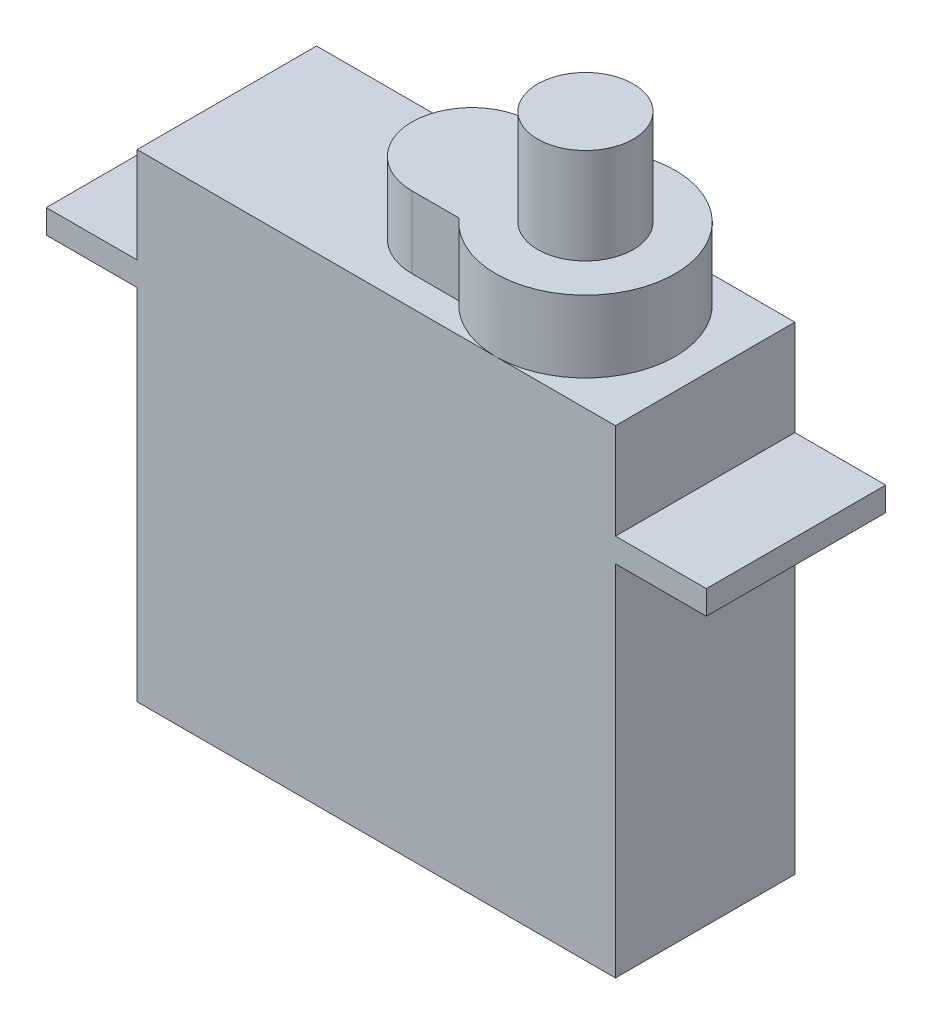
ISO-10303-21;
HEADER;
FILE_DESCRIPTION(('STEP AP214'),'2;1');
FILE_NAME('part.step','',(''),(''),'','','');
FILE_SCHEMA(('AUTOMOTIVE_DESIGN { 1 0 10303 214 1 1 1 1 }'));
ENDSEC;
DATA;
#1=APPLICATION_CONTEXT('core data for automotive mechanical design processes');
#2=APPLICATION_PROTOCOL_DEFINITION('international standard','automotive_design',2000,#1);
#3=PRODUCT_CONTEXT('',#1,'mechanical');
#4=PRODUCT('Part','Part','',(#3));
#5=PRODUCT_RELATED_PRODUCT_CATEGORY('part','',(#4));
#6=PRODUCT_DEFINITION_FORMATION('','',#4);
#7=PRODUCT_DEFINITION_CONTEXT('part definition',#1,'design');
#8=PRODUCT_DEFINITION('design','',#6,#7);
#9=PRODUCT_DEFINITION_SHAPE('','',#8);
#10=(LENGTH_UNIT() NAMED_UNIT(*) SI_UNIT(.MILLI.,.METRE.));
#11=(NAMED_UNIT(*) PLANE_ANGLE_UNIT() SI_UNIT($,.RADIAN.));
#12=(NAMED_UNIT(*) SI_UNIT($,.STERADIAN.) SOLID_ANGLE_UNIT());
#13=UNCERTAINTY_MEASURE_WITH_UNIT(LENGTH_MEASURE(1.E-05),#10,'distance_accuracy_value','');
#14=(GEOMETRIC_REPRESENTATION_CONTEXT(3) GLOBAL_UNCERTAINTY_ASSIGNED_CONTEXT((#13)) GLOBAL_UNIT_ASSIGNED_CONTEXT((#10,
#11,#12)) REPRESENTATION_CONTEXT('',''));
#15=CARTESIAN_POINT('',(0.,0.,0.));
#16=DIRECTION('',(0.,0.,1.));
#17=DIRECTION('',(1.,0.,0.));
#18=AXIS2_PLACEMENT_3D('',#15,#16,#17);
#19=CARTESIAN_POINT('',(0.,0.,7.5));
#20=DIRECTION('',(1.,0.,0.));
#21=DIRECTION('',(0.,0.,-1.));
#22=AXIS2_PLACEMENT_3D('',#19,#20,#21);
#23=PLANE('',#22);
#24=DIRECTION('',(0.,-1.,0.));
#25=VECTOR('',#24,1.);
#26=CARTESIAN_POINT('',(0.,0.,0.));
#27=LINE('',#26,#25);
#28=CARTESIAN_POINT('',(0.,15.,0.));
#29=VERTEX_POINT('',#28);
#30=CARTESIAN_POINT('',(0.,0.,0.));
#31=VERTEX_POINT('',#30);
#32=EDGE_CURVE('E183',#29,#31,#27,.T.);
#33=ORIENTED_EDGE('',*,*,#32,.T.);
#34=DIRECTION('',(0.,0.,-1.));
#35=VECTOR('',#34,1.);
#36=CARTESIAN_POINT('',(0.,0.,7.5));
#37=LINE('',#36,#35);
#38=CARTESIAN_POINT('',(0.,0.,7.5));
#39=VERTEX_POINT('',#38);
#40=EDGE_CURVE('E52',#39,#31,#37,.T.);
#41=ORIENTED_EDGE('',*,*,#40,.F.);
#42=DIRECTION('',(0.,-1.,0.));
#43=VECTOR('',#42,1.);
#44=CARTESIAN_POINT('',(0.,0.,7.5));
#45=LINE('',#44,#43);
#46=CARTESIAN_POINT('',(0.,15.,7.5));
#47=VERTEX_POINT('',#46);
#48=EDGE_CURVE('E210',#47,#39,#45,.T.);
#49=ORIENTED_EDGE('',*,*,#48,.F.);
#50=DIRECTION('',(0.,0.,-1.));
#51=VECTOR('',#50,1.);
#52=CARTESIAN_POINT('',(0.,15.,7.5));
#53=LINE('',#52,#51);
#54=EDGE_CURVE('E179',#47,#29,#53,.T.);
#55=ORIENTED_EDGE('',*,*,#54,.T.);
#56=EDGE_LOOP('',(#33,#41,#49,#55));
#57=FACE_BOUND('',#56,.T.);
#58=ADVANCED_FACE('F49',(#57),#23,.F.);
#59=CARTESIAN_POINT('',(0.,0.,7.5));
#60=DIRECTION('',(0.,1.,0.));
#61=DIRECTION('',(0.,0.,1.));
#62=AXIS2_PLACEMENT_3D('',#59,#60,#61);
#63=PLANE('',#62);
#64=DIRECTION('',(1.,0.,0.));
#65=VECTOR('',#64,1.);
#66=CARTESIAN_POINT('',(0.,0.,0.));
#67=LINE('',#66,#65);
#68=CARTESIAN_POINT('',(20.,0.,0.));
#69=VERTEX_POINT('',#68);
#70=EDGE_CURVE('E186',#31,#69,#67,.T.);
#71=ORIENTED_EDGE('',*,*,#70,.T.);
#72=DIRECTION('',(0.,0.,-1.));
#73=VECTOR('',#72,1.);
#74=CARTESIAN_POINT('',(20.,0.,7.5));
#75=LINE('',#74,#73);
#76=CARTESIAN_POINT('',(20.,0.,7.5));
#77=VERTEX_POINT('',#76);
#78=EDGE_CURVE('E231',#77,#69,#75,.T.);
#79=ORIENTED_EDGE('',*,*,#78,.F.);
#80=DIRECTION('',(1.,0.,0.));
#81=VECTOR('',#80,1.);
#82=CARTESIAN_POINT('',(0.,0.,7.5));
#83=LINE('',#82,#81);
#84=EDGE_CURVE('E127',#39,#77,#83,.T.);
#85=ORIENTED_EDGE('',*,*,#84,.F.);
#86=ORIENTED_EDGE('',*,*,#40,.T.);
#87=EDGE_LOOP('',(#71,#79,#85,#86));
#88=FACE_BOUND('',#87,.T.);
#89=ADVANCED_FACE('F237',(#88),#63,.F.);
#90=CARTESIAN_POINT('',(20.,0.,7.5));
#91=DIRECTION('',(-1.,0.,0.));
#92=DIRECTION('',(0.,0.,1.));
#93=AXIS2_PLACEMENT_3D('',#90,#91,#92);
#94=PLANE('',#93);
#95=DIRECTION('',(0.,1.,0.));
#96=VECTOR('',#95,1.);
#97=CARTESIAN_POINT('',(20.,0.,0.));
#98=LINE('',#97,#96);
#99=CARTESIAN_POINT('',(20.,15.,0.));
#100=VERTEX_POINT('',#99);
#101=EDGE_CURVE('E189',#69,#100,#98,.T.);
#102=ORIENTED_EDGE('',*,*,#101,.T.);
#103=DIRECTION('',(0.,0.,-1.));
#104=VECTOR('',#103,1.);
#105=CARTESIAN_POINT('',(20.,15.,7.5));
#106=LINE('',#105,#104);
#107=CARTESIAN_POINT('',(20.,15.,7.5));
#108=VERTEX_POINT('',#107);
#109=EDGE_CURVE('E229',#108,#100,#106,.T.);
#110=ORIENTED_EDGE('',*,*,#109,.F.);
#111=DIRECTION('',(0.,1.,0.));
#112=VECTOR('',#111,1.);
#113=CARTESIAN_POINT('',(20.,0.,7.5));
#114=LINE('',#113,#112);
#115=EDGE_CURVE('E255',#77,#108,#114,.T.);
#116=ORIENTED_EDGE('',*,*,#115,.F.);
#117=ORIENTED_EDGE('',*,*,#78,.T.);
#118=EDGE_LOOP('',(#102,#110,#116,#117));
#119=FACE_BOUND('',#118,.T.);
#120=ADVANCED_FACE('F247',(#119),#94,.F.);
#121=CARTESIAN_POINT('',(20.,15.,7.5));
#122=DIRECTION('',(0.,1.,0.));
#123=DIRECTION('',(0.,0.,1.));
#124=AXIS2_PLACEMENT_3D('',#121,#122,#123);
#125=PLANE('',#124);
#126=DIRECTION('',(1.,0.,0.));
#127=VECTOR('',#126,1.);
#128=CARTESIAN_POINT('',(20.,15.,0.));
#129=LINE('',#128,#127);
#130=CARTESIAN_POINT('',(23.8,15.,0.));
#131=VERTEX_POINT('',#130);
#132=EDGE_CURVE('E191',#100,#131,#129,.T.);
#133=ORIENTED_EDGE('',*,*,#132,.T.);
#134=DIRECTION('',(0.,0.,-1.));
#135=VECTOR('',#134,1.);
#136=CARTESIAN_POINT('',(23.8,15.,7.5));
#137=LINE('',#136,#135);
#138=CARTESIAN_POINT('',(23.8,15.,7.5));
#139=VERTEX_POINT('',#138);
#140=EDGE_CURVE('E226',#139,#131,#137,.T.);
#141=ORIENTED_EDGE('',*,*,#140,.F.);
#142=DIRECTION('',(1.,0.,0.));
#143=VECTOR('',#142,1.);
#144=CARTESIAN_POINT('',(20.,15.,7.5));
#145=LINE('',#144,#143);
#146=EDGE_CURVE('E252',#108,#139,#145,.T.);
#147=ORIENTED_EDGE('',*,*,#146,.F.);
#148=ORIENTED_EDGE('',*,*,#109,.T.);
#149=EDGE_LOOP('',(#133,#141,#147,#148));
#150=FACE_BOUND('',#149,.T.);
#151=ADVANCED_FACE('F250',(#150),#125,.F.);
#152=CARTESIAN_POINT('',(23.8,16.,7.5));
#153=DIRECTION('',(-1.,0.,0.));
#154=DIRECTION('',(0.,0.,1.));
#155=AXIS2_PLACEMENT_3D('',#152,#153,#154);
#156=PLANE('',#155);
#157=DIRECTION('',(0.,1.,0.));
#158=VECTOR('',#157,1.);
#159=CARTESIAN_POINT('',(23.8,16.,0.));
#160=LINE('',#159,#158);
#161=CARTESIAN_POINT('',(23.8,16.,0.));
#162=VERTEX_POINT('',#161);
#163=EDGE_CURVE('E193',#131,#162,#160,.T.);
#164=ORIENTED_EDGE('',*,*,#163,.T.);
#165=DIRECTION('',(0.,0.,-1.));
#166=VECTOR('',#165,1.);
#167=CARTESIAN_POINT('',(23.8,16.,7.5));
#168=LINE('',#167,#166);
#169=CARTESIAN_POINT('',(23.8,16.,7.5));
#170=VERTEX_POINT('',#169);
#171=EDGE_CURVE('E223',#170,#162,#168,.T.);
#172=ORIENTED_EDGE('',*,*,#171,.F.);
#173=DIRECTION('',(0.,1.,0.));
#174=VECTOR('',#173,1.);
#175=CARTESIAN_POINT('',(23.8,16.,7.5));
#176=LINE('',#175,#174);
#177=EDGE_CURVE('E254',#139,#170,#176,.T.);
#178=ORIENTED_EDGE('',*,*,#177,.F.);
#179=ORIENTED_EDGE('',*,*,#140,.T.);
#180=EDGE_LOOP('',(#164,#172,#178,#179));
#181=FACE_BOUND('',#180,.T.);
#182=ADVANCED_FACE('F389',(#181),#156,.F.);
#183=CARTESIAN_POINT('',(20.,16.,7.5));
#184=DIRECTION('',(0.,-1.,0.));
#185=DIRECTION('',(0.,0.,-1.));
#186=AXIS2_PLACEMENT_3D('',#183,#184,#185);
#187=PLANE('',#186);
#188=DIRECTION('',(-1.,0.,0.));
#189=VECTOR('',#188,1.);
#190=CARTESIAN_POINT('',(20.,16.,0.));
#191=LINE('',#190,#189);
#192=CARTESIAN_POINT('',(20.,16.,0.));
#193=VERTEX_POINT('',#192);
#194=EDGE_CURVE('E195',#162,#193,#191,.T.);
#195=ORIENTED_EDGE('',*,*,#194,.T.);
#196=DIRECTION('',(0.,0.,-1.));
#197=VECTOR('',#196,1.);
#198=CARTESIAN_POINT('',(20.,16.,7.5));
#199=LINE('',#198,#197);
#200=CARTESIAN_POINT('',(20.,16.,7.5));
#201=VERTEX_POINT('',#200);
#202=EDGE_CURVE('E220',#201,#193,#199,.T.);
#203=ORIENTED_EDGE('',*,*,#202,.F.);
#204=DIRECTION('',(-1.,0.,0.));
#205=VECTOR('',#204,1.);
#206=CARTESIAN_POINT('',(20.,16.,7.5));
#207=LINE('',#206,#205);
#208=EDGE_CURVE('E257',#170,#201,#207,.T.);
#209=ORIENTED_EDGE('',*,*,#208,.F.);
#210=ORIENTED_EDGE('',*,*,#171,.T.);
#211=EDGE_LOOP('',(#195,#203,#209,#210));
#212=FACE_BOUND('',#211,.T.);
#213=ADVANCED_FACE('F392',(#212),#187,.F.);
#214=CARTESIAN_POINT('',(20.,16.,7.5));
#215=DIRECTION('',(-1.,0.,0.));
#216=DIRECTION('',(0.,0.,1.));
#217=AXIS2_PLACEMENT_3D('',#214,#215,#216);
#218=PLANE('',#217);
#219=DIRECTION('',(0.,1.,0.));
#220=VECTOR('',#219,1.);
#221=CARTESIAN_POINT('',(20.,16.,0.));
#222=LINE('',#221,#220);
#223=CARTESIAN_POINT('',(20.,20.,0.));
#224=VERTEX_POINT('',#223);
#225=EDGE_CURVE('E197',#193,#224,#222,.T.);
#226=ORIENTED_EDGE('',*,*,#225,.T.);
#227=DIRECTION('',(0.,0.,-1.));
#228=VECTOR('',#227,1.);
#229=CARTESIAN_POINT('',(20.,20.,7.5));
#230=LINE('',#229,#228);
#231=CARTESIAN_POINT('',(20.,20.,7.5));
#232=VERTEX_POINT('',#231);
#233=EDGE_CURVE('E217',#232,#224,#230,.T.);
#234=ORIENTED_EDGE('',*,*,#233,.F.);
#235=DIRECTION('',(0.,1.,0.));
#236=VECTOR('',#235,1.);
#237=CARTESIAN_POINT('',(20.,16.,7.5));
#238=LINE('',#237,#236);
#239=EDGE_CURVE('E263',#201,#232,#238,.T.);
#240=ORIENTED_EDGE('',*,*,#239,.F.);
#241=ORIENTED_EDGE('',*,*,#202,.T.);
#242=EDGE_LOOP('',(#226,#234,#240,#241));
#243=FACE_BOUND('',#242,.T.);
#244=ADVANCED_FACE('F396',(#243),#218,.F.);
#245=CARTESIAN_POINT('',(18.7449884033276,20.,7.5));
#246=DIRECTION('',(0.,-1.,0.));
#247=DIRECTION('',(0.,0.,-1.));
#248=AXIS2_PLACEMENT_3D('',#245,#246,#247);
#249=PLANE('',#248);
#250=DIRECTION('',(-1.,0.,0.));
#251=VECTOR('',#250,1.);
#252=CARTESIAN_POINT('',(18.7449884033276,20.,0.));
#253=LINE('',#252,#251);
#254=CARTESIAN_POINT('',(14.9949884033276,20.,0.));
#255=VERTEX_POINT('',#254);
#256=EDGE_CURVE('E199',#224,#255,#253,.T.);
#257=ORIENTED_EDGE('',*,*,#256,.T.);
#258=CARTESIAN_POINT('',(14.9949884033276,20.,3.75));
#259=DIRECTION('',(0.,-1.,0.));
#260=DIRECTION('',(0.,0.,-1.));
#261=AXIS2_PLACEMENT_3D('',#258,#259,#260);
#262=CIRCLE('',#261,3.75);
#263=CARTESIAN_POINT('',(14.9949884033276,20.,7.5));
#264=VERTEX_POINT('',#263);
#265=EDGE_CURVE('E303',#264,#255,#262,.F.);
#266=ORIENTED_EDGE('',*,*,#265,.F.);
#267=DIRECTION('',(-1.,0.,0.));
#268=VECTOR('',#267,1.);
#269=CARTESIAN_POINT('',(18.7449884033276,20.,7.5));
#270=LINE('',#269,#268);
#271=EDGE_CURVE('E265',#232,#264,#270,.T.);
#272=ORIENTED_EDGE('',*,*,#271,.F.);
#273=ORIENTED_EDGE('',*,*,#233,.T.);
#274=EDGE_LOOP('',(#257,#266,#272,#273));
#275=FACE_BOUND('',#274,.T.);
#276=ADVANCED_FACE('F364',(#275),#249,.F.);
#277=CARTESIAN_POINT('',(0.,20.,7.5));
#278=DIRECTION('',(0.,-1.,0.));
#279=DIRECTION('',(0.,0.,-1.));
#280=AXIS2_PLACEMENT_3D('',#277,#278,#279);
#281=PLANE('',#280);
#282=DIRECTION('',(-1.,0.,0.));
#283=VECTOR('',#282,1.);
#284=CARTESIAN_POINT('',(0.,20.,0.));
#285=LINE('',#284,#283);
#286=CARTESIAN_POINT('',(0.,20.,0.));
#287=VERTEX_POINT('',#286);
#288=EDGE_CURVE('E202',#255,#287,#285,.T.);
#289=ORIENTED_EDGE('',*,*,#288,.T.);
#290=DIRECTION('',(0.,0.,-1.));
#291=VECTOR('',#290,1.);
#292=CARTESIAN_POINT('',(0.,20.,7.5));
#293=LINE('',#292,#291);
#294=CARTESIAN_POINT('',(0.,20.,7.5));
#295=VERTEX_POINT('',#294);
#296=EDGE_CURVE('E214',#295,#287,#293,.T.);
#297=ORIENTED_EDGE('',*,*,#296,.F.);
#298=DIRECTION('',(-1.,0.,0.));
#299=VECTOR('',#298,1.);
#300=CARTESIAN_POINT('',(0.,20.,7.5));
#301=LINE('',#300,#299);
#302=EDGE_CURVE('E267',#264,#295,#301,.T.);
#303=ORIENTED_EDGE('',*,*,#302,.F.);
#304=CARTESIAN_POINT('',(12.1999034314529,20.,6.25));
#305=VERTEX_POINT('',#304);
#306=EDGE_CURVE('E187',#305,#264,#262,.F.);
#307=ORIENTED_EDGE('',*,*,#306,.F.);
#308=DIRECTION('',(1.,0.,0.));
#309=VECTOR('',#308,1.);
#310=CARTESIAN_POINT('',(10.2449884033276,20.,6.25));
#311=LINE('',#310,#309);
#312=CARTESIAN_POINT('',(10.2449884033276,20.,6.25));
#313=VERTEX_POINT('',#312);
#314=EDGE_CURVE('E297',#313,#305,#311,.T.);
#315=ORIENTED_EDGE('',*,*,#314,.F.);
#316=CARTESIAN_POINT('',(10.2449884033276,20.,3.75));
#317=DIRECTION('',(0.,-1.,0.));
#318=DIRECTION('',(0.,0.,-1.));
#319=AXIS2_PLACEMENT_3D('',#316,#317,#318);
#320=CIRCLE('',#319,2.5);
#321=CARTESIAN_POINT('',(10.2449884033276,20.,1.25));
#322=VERTEX_POINT('',#321);
#323=EDGE_CURVE('E301',#322,#313,#320,.F.);
#324=ORIENTED_EDGE('',*,*,#323,.F.);
#325=DIRECTION('',(-1.,0.,0.));
#326=VECTOR('',#325,1.);
#327=CARTESIAN_POINT('',(10.2449884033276,20.,1.25));
#328=LINE('',#327,#326);
#329=CARTESIAN_POINT('',(12.1999034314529,20.,1.25));
#330=VERTEX_POINT('',#329);
#331=EDGE_CURVE('E304',#330,#322,#328,.T.);
#332=ORIENTED_EDGE('',*,*,#331,.F.);
#333=EDGE_CURVE('E300',#255,#330,#262,.F.);
#334=ORIENTED_EDGE('',*,*,#333,.F.);
#335=EDGE_LOOP('',(#289,#297,#303,#307,#315,#324,#332,#334));
#336=FACE_BOUND('',#335,.T.);
#337=ADVANCED_FACE('F275',(#336),#281,.F.);
#338=CARTESIAN_POINT('',(0.,16.,7.5));
#339=DIRECTION('',(1.,0.,0.));
#340=DIRECTION('',(0.,0.,-1.));
#341=AXIS2_PLACEMENT_3D('',#338,#339,#340);
#342=PLANE('',#341);
#343=DIRECTION('',(0.,-1.,0.));
#344=VECTOR('',#343,1.);
#345=CARTESIAN_POINT('',(0.,16.,0.));
#346=LINE('',#345,#344);
#347=CARTESIAN_POINT('',(0.,16.,0.));
#348=VERTEX_POINT('',#347);
#349=EDGE_CURVE('E204',#287,#348,#346,.T.);
#350=ORIENTED_EDGE('',*,*,#349,.T.);
#351=DIRECTION('',(0.,0.,-1.));
#352=VECTOR('',#351,1.);
#353=CARTESIAN_POINT('',(0.,16.,7.5));
#354=LINE('',#353,#352);
#355=CARTESIAN_POINT('',(0.,16.,7.5));
#356=VERTEX_POINT('',#355);
#357=EDGE_CURVE('E174',#356,#348,#354,.T.);
#358=ORIENTED_EDGE('',*,*,#357,.F.);
#359=DIRECTION('',(0.,-1.,0.));
#360=VECTOR('',#359,1.);
#361=CARTESIAN_POINT('',(0.,16.,7.5));
#362=LINE('',#361,#360);
#363=EDGE_CURVE('E162',#295,#356,#362,.T.);
#364=ORIENTED_EDGE('',*,*,#363,.F.);
#365=ORIENTED_EDGE('',*,*,#296,.T.);
#366=EDGE_LOOP('',(#350,#358,#364,#365));
#367=FACE_BOUND('',#366,.T.);
#368=ADVANCED_FACE('F279',(#367),#342,.F.);
#369=CARTESIAN_POINT('',(0.,16.,7.5));
#370=DIRECTION('',(0.,-1.,0.));
#371=DIRECTION('',(0.,0.,-1.));
#372=AXIS2_PLACEMENT_3D('',#369,#370,#371);
#373=PLANE('',#372);
#374=DIRECTION('',(-1.,0.,0.));
#375=VECTOR('',#374,1.);
#376=CARTESIAN_POINT('',(0.,16.,0.));
#377=LINE('',#376,#375);
#378=CARTESIAN_POINT('',(-3.8,16.,0.));
#379=VERTEX_POINT('',#378);
#380=EDGE_CURVE('E171',#348,#379,#377,.T.);
#381=ORIENTED_EDGE('',*,*,#380,.T.);
#382=DIRECTION('',(0.,0.,-1.));
#383=VECTOR('',#382,1.);
#384=CARTESIAN_POINT('',(-3.8,16.,7.5));
#385=LINE('',#384,#383);
#386=CARTESIAN_POINT('',(-3.8,16.,7.5));
#387=VERTEX_POINT('',#386);
#388=EDGE_CURVE('E168',#387,#379,#385,.T.);
#389=ORIENTED_EDGE('',*,*,#388,.F.);
#390=DIRECTION('',(-1.,0.,0.));
#391=VECTOR('',#390,1.);
#392=CARTESIAN_POINT('',(0.,16.,7.5));
#393=LINE('',#392,#391);
#394=EDGE_CURVE('E154',#356,#387,#393,.T.);
#395=ORIENTED_EDGE('',*,*,#394,.F.);
#396=ORIENTED_EDGE('',*,*,#357,.T.);
#397=EDGE_LOOP('',(#381,#389,#395,#396));
#398=FACE_BOUND('',#397,.T.);
#399=ADVANCED_FACE('F169',(#398),#373,.F.);
#400=CARTESIAN_POINT('',(-3.8,16.,7.5));
#401=DIRECTION('',(1.,0.,0.));
#402=DIRECTION('',(0.,0.,-1.));
#403=AXIS2_PLACEMENT_3D('',#400,#401,#402);
#404=PLANE('',#403);
#405=DIRECTION('',(0.,-1.,0.));
#406=VECTOR('',#405,1.);
#407=CARTESIAN_POINT('',(-3.8,16.,0.));
#408=LINE('',#407,#406);
#409=CARTESIAN_POINT('',(-3.8,15.,0.));
#410=VERTEX_POINT('',#409);
#411=EDGE_CURVE('E207',#379,#410,#408,.T.);
#412=ORIENTED_EDGE('',*,*,#411,.T.);
#413=DIRECTION('',(0.,0.,-1.));
#414=VECTOR('',#413,1.);
#415=CARTESIAN_POINT('',(-3.8,15.,7.5));
#416=LINE('',#415,#414);
#417=CARTESIAN_POINT('',(-3.8,15.,7.5));
#418=VERTEX_POINT('',#417);
#419=EDGE_CURVE('E175',#418,#410,#416,.T.);
#420=ORIENTED_EDGE('',*,*,#419,.F.);
#421=DIRECTION('',(0.,-1.,0.));
#422=VECTOR('',#421,1.);
#423=CARTESIAN_POINT('',(-3.8,16.,7.5));
#424=LINE('',#423,#422);
#425=EDGE_CURVE('E159',#387,#418,#424,.T.);
#426=ORIENTED_EDGE('',*,*,#425,.F.);
#427=ORIENTED_EDGE('',*,*,#388,.T.);
#428=EDGE_LOOP('',(#412,#420,#426,#427));
#429=FACE_BOUND('',#428,.T.);
#430=ADVANCED_FACE('F177',(#429),#404,.F.);
#431=CARTESIAN_POINT('',(0.,15.,7.5));
#432=DIRECTION('',(0.,1.,0.));
#433=DIRECTION('',(0.,0.,1.));
#434=AXIS2_PLACEMENT_3D('',#431,#432,#433);
#435=PLANE('',#434);
#436=DIRECTION('',(1.,0.,0.));
#437=VECTOR('',#436,1.);
#438=CARTESIAN_POINT('',(0.,15.,0.));
#439=LINE('',#438,#437);
#440=EDGE_CURVE('E118',#410,#29,#439,.T.);
#441=ORIENTED_EDGE('',*,*,#440,.T.);
#442=ORIENTED_EDGE('',*,*,#54,.F.);
#443=DIRECTION('',(1.,0.,0.));
#444=VECTOR('',#443,1.);
#445=CARTESIAN_POINT('',(0.,15.,7.5));
#446=LINE('',#445,#444);
#447=EDGE_CURVE('E73',#418,#47,#446,.T.);
#448=ORIENTED_EDGE('',*,*,#447,.F.);
#449=ORIENTED_EDGE('',*,*,#419,.T.);
#450=EDGE_LOOP('',(#441,#442,#448,#449));
#451=FACE_BOUND('',#450,.T.);
#452=ADVANCED_FACE('F280',(#451),#435,.F.);
#453=CARTESIAN_POINT('',(0.,0.,7.5));
#454=DIRECTION('',(0.,0.,1.));
#455=DIRECTION('',(1.,0.,0.));
#456=AXIS2_PLACEMENT_3D('',#453,#454,#455);
#457=PLANE('',#456);
#458=ORIENTED_EDGE('',*,*,#271,.T.);
#459=ORIENTED_EDGE('',*,*,#302,.T.);
#460=ORIENTED_EDGE('',*,*,#363,.T.);
#461=ORIENTED_EDGE('',*,*,#394,.T.);
#462=ORIENTED_EDGE('',*,*,#425,.T.);
#463=ORIENTED_EDGE('',*,*,#447,.T.);
#464=ORIENTED_EDGE('',*,*,#48,.T.);
#465=ORIENTED_EDGE('',*,*,#84,.T.);
#466=ORIENTED_EDGE('',*,*,#115,.T.);
#467=ORIENTED_EDGE('',*,*,#146,.T.);
#468=ORIENTED_EDGE('',*,*,#177,.T.);
#469=ORIENTED_EDGE('',*,*,#208,.T.);
#470=ORIENTED_EDGE('',*,*,#239,.T.);
#471=EDGE_LOOP('',(#458,#459,#460,#461,#462,#463,#464,#465,#466,#467,#468,#469,#470));
#472=FACE_BOUND('',#471,.T.);
#473=ADVANCED_FACE('F157',(#472),#457,.T.);
#474=CARTESIAN_POINT('',(0.,0.,0.));
#475=DIRECTION('',(0.,0.,1.));
#476=DIRECTION('',(1.,0.,0.));
#477=AXIS2_PLACEMENT_3D('',#474,#475,#476);
#478=PLANE('',#477);
#479=ORIENTED_EDGE('',*,*,#288,.F.);
#480=ORIENTED_EDGE('',*,*,#256,.F.);
#481=ORIENTED_EDGE('',*,*,#225,.F.);
#482=ORIENTED_EDGE('',*,*,#194,.F.);
#483=ORIENTED_EDGE('',*,*,#163,.F.);
#484=ORIENTED_EDGE('',*,*,#132,.F.);
#485=ORIENTED_EDGE('',*,*,#101,.F.);
#486=ORIENTED_EDGE('',*,*,#70,.F.);
#487=ORIENTED_EDGE('',*,*,#32,.F.);
#488=ORIENTED_EDGE('',*,*,#440,.F.);
#489=ORIENTED_EDGE('',*,*,#411,.F.);
#490=ORIENTED_EDGE('',*,*,#380,.F.);
#491=ORIENTED_EDGE('',*,*,#349,.F.);
#492=EDGE_LOOP('',(#479,#480,#481,#482,#483,#484,#485,#486,#487,#488,#489,#490,#491));
#493=FACE_BOUND('',#492,.T.);
#494=ADVANCED_FACE('F243',(#493),#478,.F.);
#495=CARTESIAN_POINT('',(10.2449884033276,-9.89232493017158,3.75));
#496=DIRECTION('',(0.,1.,0.));
#497=DIRECTION('',(0.,0.,1.));
#498=AXIS2_PLACEMENT_3D('',#495,#496,#497);
#499=CYLINDRICAL_SURFACE('',#498,2.5);
#500=ORIENTED_EDGE('',*,*,#323,.T.);
#501=DIRECTION('',(0.,1.,0.));
#502=VECTOR('',#501,1.);
#503=CARTESIAN_POINT('',(10.2449884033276,-9.89232493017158,6.25));
#504=LINE('',#503,#502);
#505=CARTESIAN_POINT('',(10.2449884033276,23.,6.25));
#506=VERTEX_POINT('',#505);
#507=EDGE_CURVE('E283',#313,#506,#504,.T.);
#508=ORIENTED_EDGE('',*,*,#507,.T.);
#509=CARTESIAN_POINT('',(10.2449884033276,23.,3.75));
#510=DIRECTION('',(0.,1.,0.));
#511=DIRECTION('',(0.,0.,1.));
#512=AXIS2_PLACEMENT_3D('',#509,#510,#511);
#513=CIRCLE('',#512,2.5);
#514=CARTESIAN_POINT('',(10.2449884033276,23.,1.25));
#515=VERTEX_POINT('',#514);
#516=EDGE_CURVE('E292',#515,#506,#513,.T.);
#517=ORIENTED_EDGE('',*,*,#516,.F.);
#518=DIRECTION('',(0.,1.,0.));
#519=VECTOR('',#518,1.);
#520=CARTESIAN_POINT('',(10.2449884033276,-9.89232493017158,1.25));
#521=LINE('',#520,#519);
#522=EDGE_CURVE('E293',#322,#515,#521,.T.);
#523=ORIENTED_EDGE('',*,*,#522,.F.);
#524=EDGE_LOOP('',(#500,#508,#517,#523));
#525=FACE_BOUND('',#524,.T.);
#526=ADVANCED_FACE('F343',(#525),#499,.T.);
#527=CARTESIAN_POINT('',(14.9949884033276,-9.89232493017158,3.75));
#528=DIRECTION('',(0.,1.,0.));
#529=DIRECTION('',(0.,0.,1.));
#530=AXIS2_PLACEMENT_3D('',#527,#528,#529);
#531=CYLINDRICAL_SURFACE('',#530,3.75);
#532=ORIENTED_EDGE('',*,*,#306,.T.);
#533=ORIENTED_EDGE('',*,*,#265,.T.);
#534=ORIENTED_EDGE('',*,*,#333,.T.);
#535=DIRECTION('',(0.,1.,0.));
#536=VECTOR('',#535,1.);
#537=CARTESIAN_POINT('',(12.1999034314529,-9.89232493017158,1.25));
#538=LINE('',#537,#536);
#539=CARTESIAN_POINT('',(12.1999034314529,23.,1.25));
#540=VERTEX_POINT('',#539);
#541=EDGE_CURVE('E290',#330,#540,#538,.T.);
#542=ORIENTED_EDGE('',*,*,#541,.T.);
#543=CARTESIAN_POINT('',(14.9949884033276,23.,3.75));
#544=DIRECTION('',(0.,1.,0.));
#545=DIRECTION('',(0.,0.,1.));
#546=AXIS2_PLACEMENT_3D('',#543,#544,#545);
#547=CIRCLE('',#546,3.75);
#548=CARTESIAN_POINT('',(12.1999034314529,23.,6.25));
#549=VERTEX_POINT('',#548);
#550=EDGE_CURVE('E64',#549,#540,#547,.T.);
#551=ORIENTED_EDGE('',*,*,#550,.F.);
#552=DIRECTION('',(0.,1.,0.));
#553=VECTOR('',#552,1.);
#554=CARTESIAN_POINT('',(12.1999034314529,-9.89232493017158,6.25));
#555=LINE('',#554,#553);
#556=EDGE_CURVE('E287',#305,#549,#555,.T.);
#557=ORIENTED_EDGE('',*,*,#556,.F.);
#558=EDGE_LOOP('',(#532,#533,#534,#542,#551,#557));
#559=FACE_BOUND('',#558,.T.);
#560=ADVANCED_FACE('F348',(#559),#531,.T.);
#561=CARTESIAN_POINT('',(10.2449884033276,-9.89232493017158,1.25));
#562=DIRECTION('',(0.,0.,-1.));
#563=DIRECTION('',(-1.,0.,0.));
#564=AXIS2_PLACEMENT_3D('',#561,#562,#563);
#565=PLANE('',#564);
#566=ORIENTED_EDGE('',*,*,#331,.T.);
#567=ORIENTED_EDGE('',*,*,#522,.T.);
#568=DIRECTION('',(-1.,0.,0.));
#569=VECTOR('',#568,1.);
#570=CARTESIAN_POINT('',(10.2449884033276,23.,1.25));
#571=LINE('',#570,#569);
#572=EDGE_CURVE('E289',#540,#515,#571,.T.);
#573=ORIENTED_EDGE('',*,*,#572,.F.);
#574=ORIENTED_EDGE('',*,*,#541,.F.);
#575=EDGE_LOOP('',(#566,#567,#573,#574));
#576=FACE_BOUND('',#575,.T.);
#577=ADVANCED_FACE('F368',(#576),#565,.T.);
#578=CARTESIAN_POINT('',(10.2449884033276,-9.89232493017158,6.25));
#579=DIRECTION('',(0.,0.,1.));
#580=DIRECTION('',(1.,0.,0.));
#581=AXIS2_PLACEMENT_3D('',#578,#579,#580);
#582=PLANE('',#581);
#583=ORIENTED_EDGE('',*,*,#314,.T.);
#584=ORIENTED_EDGE('',*,*,#556,.T.);
#585=DIRECTION('',(1.,0.,0.));
#586=VECTOR('',#585,1.);
#587=CARTESIAN_POINT('',(10.2449884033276,23.,6.25));
#588=LINE('',#587,#586);
#589=EDGE_CURVE('E286',#506,#549,#588,.T.);
#590=ORIENTED_EDGE('',*,*,#589,.F.);
#591=ORIENTED_EDGE('',*,*,#507,.F.);
#592=EDGE_LOOP('',(#583,#584,#590,#591));
#593=FACE_BOUND('',#592,.T.);
#594=ADVANCED_FACE('F330',(#593),#582,.T.);
#595=CARTESIAN_POINT('',(7.74498840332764,23.,7.5));
#596=DIRECTION('',(0.,-1.,0.));
#597=DIRECTION('',(0.,0.,-1.));
#598=AXIS2_PLACEMENT_3D('',#595,#596,#597);
#599=PLANE('',#598);
#600=CARTESIAN_POINT('',(14.9949884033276,23.,3.75));
#601=DIRECTION('',(0.,1.,0.));
#602=DIRECTION('',(0.,0.,1.));
#603=AXIS2_PLACEMENT_3D('',#600,#601,#602);
#604=CIRCLE('',#603,2.);
#605=CARTESIAN_POINT('',(14.9949884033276,23.,5.75));
#606=VERTEX_POINT('',#605);
#607=EDGE_CURVE('E14',#606,#606,#604,.T.);
#608=ORIENTED_EDGE('',*,*,#607,.F.);
#609=EDGE_LOOP('',(#608));
#610=FACE_BOUND('',#609,.T.);
#611=ORIENTED_EDGE('',*,*,#516,.T.);
#612=ORIENTED_EDGE('',*,*,#589,.T.);
#613=ORIENTED_EDGE('',*,*,#550,.T.);
#614=ORIENTED_EDGE('',*,*,#572,.T.);
#615=EDGE_LOOP('',(#611,#612,#613,#614));
#616=FACE_BOUND('',#615,.T.);
#617=ADVANCED_FACE('F324',(#610,#616),#599,.F.);
#618=CARTESIAN_POINT('',(14.9949884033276,27.,3.75));
#619=DIRECTION('',(0.,-1.,0.));
#620=DIRECTION('',(0.,0.,-1.));
#621=AXIS2_PLACEMENT_3D('',#618,#619,#620);
#622=CYLINDRICAL_SURFACE('',#621,2.);
#623=CARTESIAN_POINT('',(14.9949884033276,27.,3.75));
#624=DIRECTION('',(0.,1.,0.));
#625=DIRECTION('',(0.,0.,1.));
#626=AXIS2_PLACEMENT_3D('',#623,#624,#625);
#627=CIRCLE('',#626,2.);
#628=CARTESIAN_POINT('',(14.9949884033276,27.,5.75));
#629=VERTEX_POINT('',#628);
#630=EDGE_CURVE('E296',#629,#629,#627,.T.);
#631=ORIENTED_EDGE('',*,*,#630,.F.);
#632=EDGE_LOOP('',(#631));
#633=FACE_BOUND('',#632,.T.);
#634=ORIENTED_EDGE('',*,*,#607,.T.);
#635=EDGE_LOOP('',(#634));
#636=FACE_BOUND('',#635,.T.);
#637=ADVANCED_FACE('F321',(#633,#636),#622,.T.);
#638=CARTESIAN_POINT('',(14.9949884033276,27.,3.75));
#639=DIRECTION('',(0.,1.,0.));
#640=DIRECTION('',(0.,0.,1.));
#641=AXIS2_PLACEMENT_3D('',#638,#639,#640);
#642=PLANE('',#641);
#643=ORIENTED_EDGE('',*,*,#630,.T.);
#644=EDGE_LOOP('',(#643));
#645=FACE_BOUND('',#644,.T.);
#646=ADVANCED_FACE('F319',(#645),#642,.T.);
#647=CLOSED_SHELL('',(#58,#89,#120,#151,#182,#213,#244,#276,#337,#368,#399,#430,#452,#473,#494,
#526,#560,#577,#594,#617,#637,#646));
#648=MANIFOLD_SOLID_BREP('B2',#647);
#649=ADVANCED_BREP_SHAPE_REPRESENTATION('',(#18,#648),#14);
#650=SHAPE_DEFINITION_REPRESENTATION(#9,#649);
ENDSEC;
END-ISO-10303-21;
